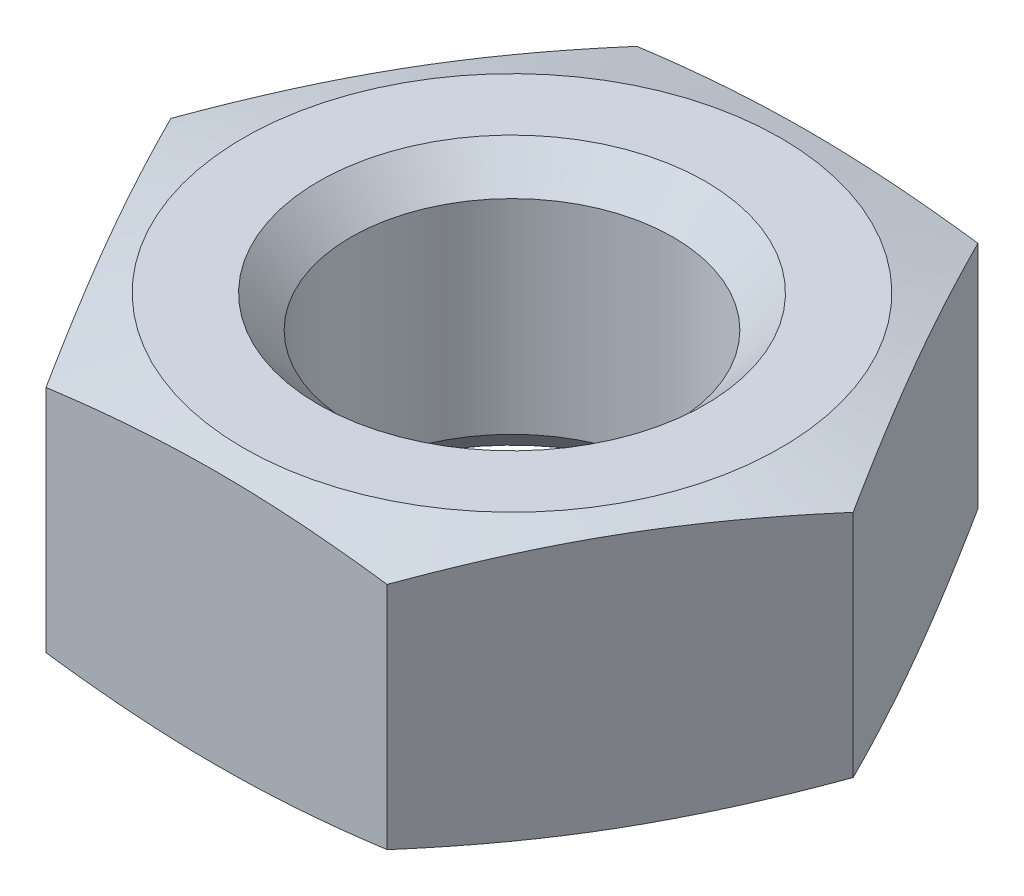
from build123d import *

# Parameters (mm, degrees)
SKETCH1_R      = 1.5
EXTRUDE1_DEPTH = 2.5


with BuildPart() as part:
    # Sketch1 → Extrude1 (new body)
    with BuildSketch(Plane(origin=(0, 0, 0), x_dir=(1, 0, 0), z_dir=(0, 1, 0))):
        Polygon((-3.175426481, 0), (-1.58771324, 2.75), (1.58771324, 2.75), (3.175426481, 0), (1.58771324, -2.75), (-1.58771324, -2.75), align=None)
        with Locations(Location((0, 0, 0), (0, 0, 270))):
            Circle(SKETCH1_R, mode=Mode.SUBTRACT)
    extrude(amount=EXTRUDE1_DEPTH)

    # Sketch2 → Cut-Revolve1 (revolve, cut)
    with BuildSketch(Plane.XY, mode=Mode.PRIVATE) as cut_revolve1_sk:
        Polygon((1.5, 2.5), (1.8, 2.5), (1.5, 2.2), align=None)
        Polygon((1.5, 0), (1.8, 0), (1.5, 0.3), align=None)
        Polygon((3.175426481, 0), (3.175426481, 0.18097998), (2.5, 0), align=None)
        Polygon((3.175426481, 2.5), (3.175426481, 2.31902002), (2.5, 2.5), align=None)
    revolve(cut_revolve1_sk.sketch.rotate(Axis((0, 0, 0), (0, 1, 0)), 90), axis=Axis((0, 0, 0), (0, 1, 0)), mode=Mode.SUBTRACT)


solid = part.part
